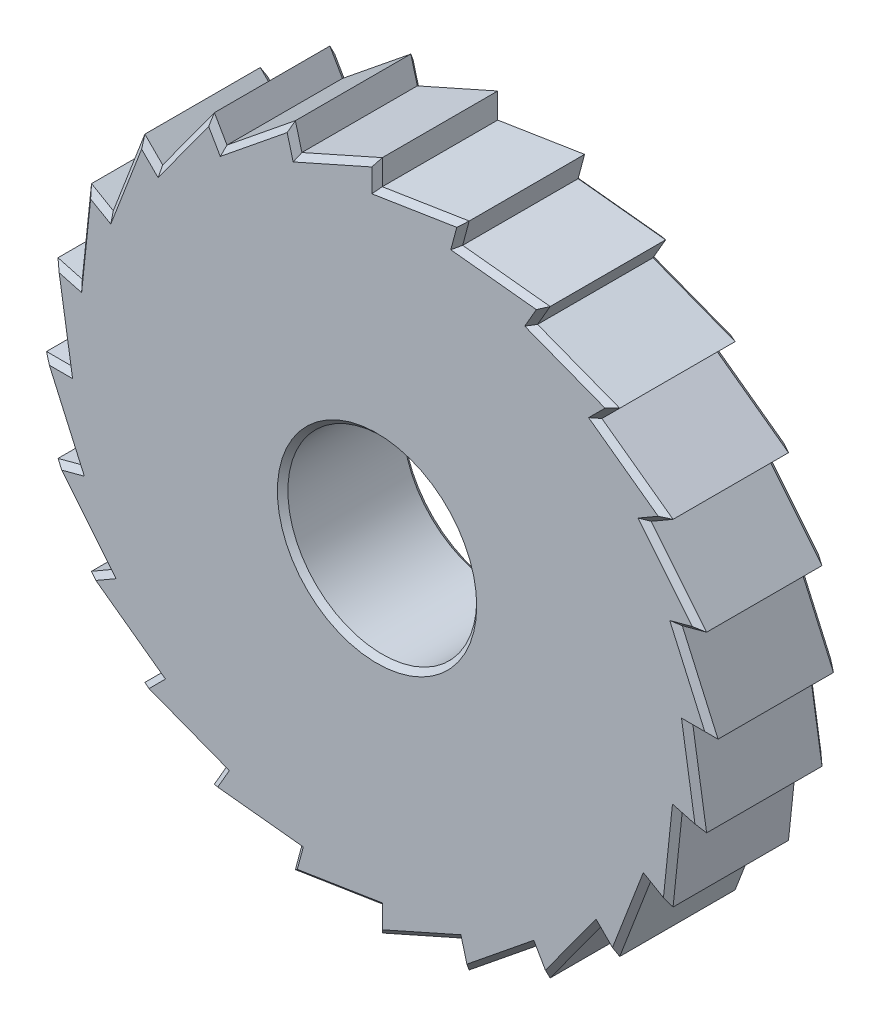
from build123d import *

# Parameters (mm, degrees)
SKETCH_1_R      = 4.5
EXTRUDE_1_DEPTH = 6
CHAMFER_1_SIZE  = 0.25


with BuildPart() as part:
    # Sketch 1 → Extrude 1 (new body)
    with BuildSketch(Plane.XY):
        Polygon((0, 16), (0, 14.8), (4.141104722, 15.454813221), (3.830521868, 14.295702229), (8, 13.856406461), (7.4, 12.817175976), (11.313708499, 11.313708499), (10.465180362, 10.465180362), (13.856406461, 8), (12.817175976, 7.4), (15.454813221, 4.141104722), (14.295702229, 3.830521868), (16, 0), (14.8, 0), (15.454813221, -4.141104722), (14.295702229, -3.830521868), (13.856406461, -8), (12.817175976, -7.4), (11.313708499, -11.313708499), (10.465180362, -10.465180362), (8, -13.856406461), (7.4, -12.817175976), (4.141104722, -15.454813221), (3.830521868, -14.295702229), (0, -16), (0, -14.8), (-4.141104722, -15.454813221), (-3.830521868, -14.295702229), (-8, -13.856406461), (-7.4, -12.817175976), (-11.313708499, -11.313708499), (-10.465180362, -10.465180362), (-13.856406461, -8), (-12.817175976, -7.4), (-15.454813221, -4.141104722), (-14.295702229, -3.830521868), (-16, 0), (-14.8, 0), (-15.454813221, 4.141104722), (-14.295702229, 3.830521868), (-13.856406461, 8), (-12.817175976, 7.4), (-11.313708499, 11.313708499), (-10.465180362, 10.465180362), (-8, 13.856406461), (-7.4, 12.817175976), (-4.141104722, 15.454813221), (-3.830521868, 14.295702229), align=None)
        Circle(SKETCH_1_R, mode=Mode.SUBTRACT)
    extrude(amount=EXTRUDE_1_DEPTH)

    # Chamfer 1
    chamfer_1_edges = [part.edges().sort_by_distance(p)[0] for p in [
        (-5.770552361, 14.135994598, 6),
        (14.076054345, -5.915260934, 6),
        (14.875257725, -3.985813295, 6),
        (15.12740661, -2.070552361, 6),
        (-4.5, 0, 0),
        (15.4, 0, 6),
        (-4.5, 0, 6),
        (15.147851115, 1.915260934, 6),
        (14.875257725, 3.985813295, 6),
        (14.135994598, 5.770552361, 6),
        (13.336791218, 7.7, 6),
        (12.160793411, 9.232590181, 6),
        (10.88944443, 10.88944443, 6),
        (-7.7, 13.336791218, 6),
        (9.356854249, 12.065442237, 6),
        (7.7, 13.336791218, 6),
        (5.915260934, 14.076054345, 6),
        (3.985813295, 14.875257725, 6),
        (2.070552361, 15.12740661, 6),
        (0, 15.4, 6),
        (-9.232590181, 12.160793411, 6),
        (-10.88944443, 10.88944443, 6),
        (-12.065442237, 9.356854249, 6),
        (-13.336791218, 7.7, 6),
        (-14.076054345, 5.915260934, 6),
        (-14.875257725, 3.985813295, 6),
        (-15.12740661, 2.070552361, 6),
        (-15.4, 0, 6),
        (0, 15.4, 0),
        (-1.915260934, 15.147851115, 6),
        (-15.147851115, -1.915260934, 6),
        (2.070552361, 15.12740661, 0),
        (3.985813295, 14.875257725, 0),
        (5.915260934, 14.076054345, 0),
        (7.7, 13.336791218, 0),
        (9.356854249, 12.065442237, 0),
        (10.88944443, 10.88944443, 0),
        (12.160793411, 9.232590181, 0),
        (13.336791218, 7.7, 0),
        (-14.875257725, -3.985813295, 6),
        (14.135994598, 5.770552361, 0),
        (14.875257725, 3.985813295, 0),
        (15.147851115, 1.915260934, 0),
        (15.4, 0, 0),
        (15.12740661, -2.070552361, 0),
        (14.875257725, -3.985813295, 0),
        (14.076054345, -5.915260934, 0),
        (-14.135994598, -5.770552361, 6),
        (13.336791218, -7.7, 0),
        (12.065442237, -9.356854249, 0),
        (10.88944443, -10.88944443, 0),
        (9.232590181, -12.160793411, 0),
        (7.7, -13.336791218, 0),
        (5.770552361, -14.135994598, 0),
        (3.985813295, -14.875257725, 0),
        (1.915260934, -15.147851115, 0),
        (-13.336791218, -7.7, 6),
        (0, -15.4, 0),
        (-2.070552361, -15.12740661, 0),
        (-3.985813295, -14.875257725, 0),
        (-5.915260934, -14.076054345, 0),
        (-7.7, -13.336791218, 0),
        (-9.356854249, -12.065442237, 0),
        (-10.88944443, -10.88944443, 0),
        (-12.160793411, -9.232590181, 6),
        (-12.160793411, -9.232590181, 0),
        (-13.336791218, -7.7, 0),
        (-14.135994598, -5.770552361, 0),
        (-14.875257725, -3.985813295, 0),
        (-15.147851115, -1.915260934, 0),
        (-15.4, 0, 0),
        (-15.12740661, 2.070552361, 0),
        (-14.875257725, 3.985813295, 0),
        (-10.88944443, -10.88944443, 6),
        (-14.076054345, 5.915260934, 0),
        (-13.336791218, 7.7, 0),
        (-12.065442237, 9.356854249, 0),
        (-10.88944443, 10.88944443, 0),
        (-9.232590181, 12.160793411, 0),
        (-7.7, 13.336791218, 0),
        (-5.770552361, 14.135994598, 0),
        (-9.356854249, -12.065442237, 6),
        (-3.985813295, 14.875257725, 0),
        (-1.915260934, 15.147851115, 0),
        (-7.7, -13.336791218, 6),
        (-5.915260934, -14.076054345, 6),
        (-3.985813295, -14.875257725, 6),
        (-3.985813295, 14.875257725, 6),
        (-2.070552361, -15.12740661, 6),
        (0, -15.4, 6),
        (1.915260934, -15.147851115, 6),
        (3.985813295, -14.875257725, 6),
        (5.770552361, -14.135994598, 6),
        (7.7, -13.336791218, 6),
        (9.232590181, -12.160793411, 6),
        (10.88944443, -10.88944443, 6),
        (12.065442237, -9.356854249, 6),
        (13.336791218, -7.7, 6),
    ]]
    chamfer(chamfer_1_edges, length=CHAMFER_1_SIZE)


solid = part.part
